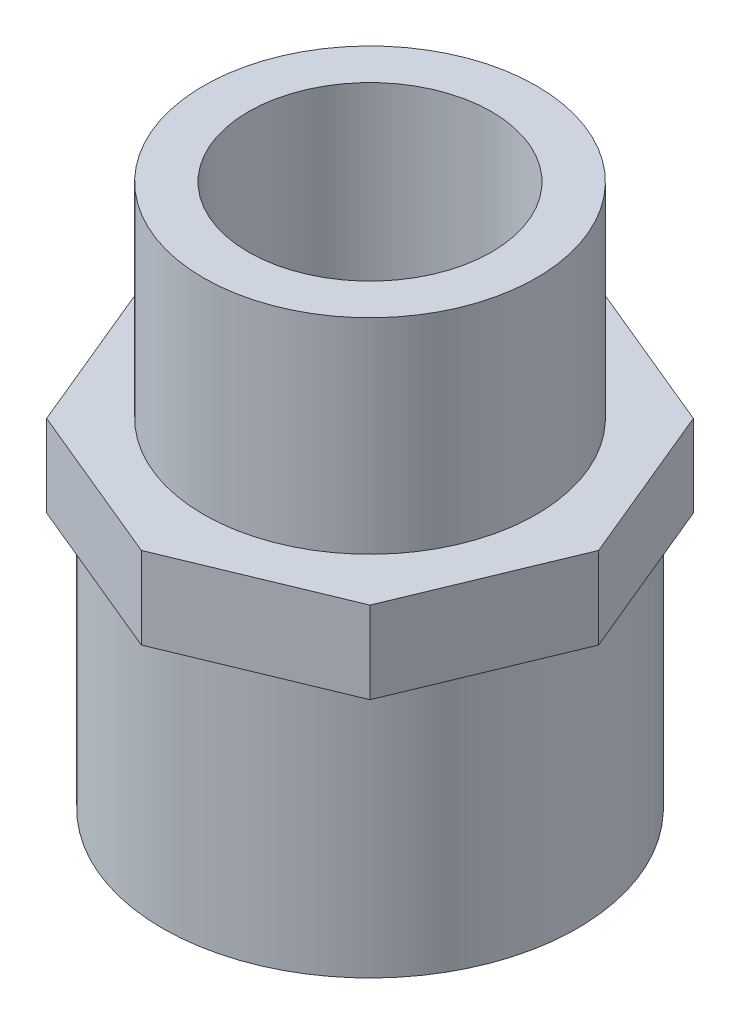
ISO-10303-21;
HEADER;
FILE_DESCRIPTION(('STEP AP214'),'2;1');
FILE_NAME('part.step','',(''),(''),'','','');
FILE_SCHEMA(('AUTOMOTIVE_DESIGN { 1 0 10303 214 1 1 1 1 }'));
ENDSEC;
DATA;
#1=APPLICATION_CONTEXT('core data for automotive mechanical design processes');
#2=APPLICATION_PROTOCOL_DEFINITION('international standard','automotive_design',2000,#1);
#3=PRODUCT_CONTEXT('',#1,'mechanical');
#4=PRODUCT('Part','Part','',(#3));
#5=PRODUCT_RELATED_PRODUCT_CATEGORY('part','',(#4));
#6=PRODUCT_DEFINITION_FORMATION('','',#4);
#7=PRODUCT_DEFINITION_CONTEXT('part definition',#1,'design');
#8=PRODUCT_DEFINITION('design','',#6,#7);
#9=PRODUCT_DEFINITION_SHAPE('','',#8);
#10=(LENGTH_UNIT() NAMED_UNIT(*) SI_UNIT(.MILLI.,.METRE.));
#11=(NAMED_UNIT(*) PLANE_ANGLE_UNIT() SI_UNIT($,.RADIAN.));
#12=(NAMED_UNIT(*) SI_UNIT($,.STERADIAN.) SOLID_ANGLE_UNIT());
#13=UNCERTAINTY_MEASURE_WITH_UNIT(LENGTH_MEASURE(1.E-05),#10,'distance_accuracy_value','');
#14=(GEOMETRIC_REPRESENTATION_CONTEXT(3) GLOBAL_UNCERTAINTY_ASSIGNED_CONTEXT((#13)) GLOBAL_UNIT_ASSIGNED_CONTEXT((#10,
#11,#12)) REPRESENTATION_CONTEXT('',''));
#15=CARTESIAN_POINT('',(0.,0.,0.));
#16=DIRECTION('',(0.,0.,1.));
#17=DIRECTION('',(1.,0.,0.));
#18=AXIS2_PLACEMENT_3D('',#15,#16,#17);
#19=CARTESIAN_POINT('',(27.3790269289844,8.12799999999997,-11.3407642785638));
#20=DIRECTION('',(0.,1.,0.));
#21=DIRECTION('',(0.,0.,1.));
#22=AXIS2_PLACEMENT_3D('',#19,#20,#21);
#23=PLANE('',#22);
#24=DIRECTION('',(0.382683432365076,0.,-0.923879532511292));
#25=VECTOR('',#24,1.);
#26=CARTESIAN_POINT('',(16.0382626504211,8.12799999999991,16.0382626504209));
#27=LINE('',#26,#25);
#28=CARTESIAN_POINT('',(16.0382626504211,8.12799999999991,16.0382626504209));
#29=VERTEX_POINT('',#28);
#30=CARTESIAN_POINT('',(22.681528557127,8.12800000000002,-1.2490009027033E-13));
#31=VERTEX_POINT('',#30);
#32=EDGE_CURVE('E165',#29,#31,#27,.T.);
#33=ORIENTED_EDGE('',*,*,#32,.T.);
#34=DIRECTION('',(-0.382683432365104,0.,-0.923879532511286));
#35=VECTOR('',#34,1.);
#36=CARTESIAN_POINT('',(22.681528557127,8.12800000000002,-1.2490009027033E-13));
#37=LINE('',#36,#35);
#38=CARTESIAN_POINT('',(16.0382626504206,8.12800000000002,-16.0382626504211));
#39=VERTEX_POINT('',#38);
#40=EDGE_CURVE('E100',#31,#39,#37,.T.);
#41=ORIENTED_EDGE('',*,*,#40,.T.);
#42=DIRECTION('',(-0.923879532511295,0.,-0.382683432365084));
#43=VECTOR('',#42,1.);
#44=CARTESIAN_POINT('',(16.0382626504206,8.12800000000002,-16.0382626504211));
#45=LINE('',#44,#43);
#46=CARTESIAN_POINT('',(-4.71844785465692E-13,8.12799999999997,-22.6815285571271));
#47=VERTEX_POINT('',#46);
#48=EDGE_CURVE('E206',#39,#47,#45,.T.);
#49=ORIENTED_EDGE('',*,*,#48,.T.);
#50=DIRECTION('',(-0.923879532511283,0.,0.382683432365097));
#51=VECTOR('',#50,1.);
#52=CARTESIAN_POINT('',(-4.71844785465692E-13,8.12799999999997,-22.6815285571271));
#53=LINE('',#52,#51);
#54=CARTESIAN_POINT('',(-16.0382626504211,8.12800000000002,-16.0382626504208));
#55=VERTEX_POINT('',#54);
#56=EDGE_CURVE('E204',#47,#55,#53,.T.);
#57=ORIENTED_EDGE('',*,*,#56,.T.);
#58=DIRECTION('',(-0.382683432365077,0.,0.923879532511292));
#59=VECTOR('',#58,1.);
#60=CARTESIAN_POINT('',(-16.0382626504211,8.12800000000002,-16.0382626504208));
#61=LINE('',#60,#59);
#62=CARTESIAN_POINT('',(-22.6815285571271,8.12800000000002,1.31838984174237E-13));
#63=VERTEX_POINT('',#62);
#64=EDGE_CURVE('E119',#55,#63,#61,.T.);
#65=ORIENTED_EDGE('',*,*,#64,.T.);
#66=DIRECTION('',(0.382683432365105,0.,0.923879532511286));
#67=VECTOR('',#66,1.);
#68=CARTESIAN_POINT('',(-22.6815285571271,8.12800000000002,1.31838984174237E-13));
#69=LINE('',#68,#67);
#70=CARTESIAN_POINT('',(-16.038262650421,8.12799999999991,16.0382626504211));
#71=VERTEX_POINT('',#70);
#72=EDGE_CURVE('E113',#63,#71,#69,.T.);
#73=ORIENTED_EDGE('',*,*,#72,.T.);
#74=DIRECTION('',(0.923879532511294,0.,0.382683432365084));
#75=VECTOR('',#74,1.);
#76=CARTESIAN_POINT('',(-16.038262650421,8.12799999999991,16.0382626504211));
#77=LINE('',#76,#75);
#78=CARTESIAN_POINT('',(0.,8.12799999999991,22.6815285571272));
#79=VERTEX_POINT('',#78);
#80=EDGE_CURVE('E117',#71,#79,#77,.T.);
#81=ORIENTED_EDGE('',*,*,#80,.T.);
#82=DIRECTION('',(0.923879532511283,0.,-0.382683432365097));
#83=VECTOR('',#82,1.);
#84=CARTESIAN_POINT('',(0.,8.12799999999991,22.6815285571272));
#85=LINE('',#84,#83);
#86=EDGE_CURVE('E56',#79,#29,#85,.T.);
#87=ORIENTED_EDGE('',*,*,#86,.T.);
#88=EDGE_LOOP('',(#33,#41,#49,#57,#65,#73,#81,#87));
#89=FACE_BOUND('',#88,.T.);
#90=CARTESIAN_POINT('',(0.,8.12800000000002,0.));
#91=DIRECTION('',(0.,1.,0.));
#92=DIRECTION('',(0.,0.,1.));
#93=AXIS2_PLACEMENT_3D('',#90,#91,#92);
#94=CIRCLE('',#93,16.51);
#95=CARTESIAN_POINT('',(0.,8.12800000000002,16.5100000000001));
#96=VERTEX_POINT('',#95);
#97=EDGE_CURVE('E233',#96,#96,#94,.T.);
#98=ORIENTED_EDGE('',*,*,#97,.F.);
#99=EDGE_LOOP('',(#98));
#100=FACE_BOUND('',#99,.T.);
#101=ADVANCED_FACE('F38',(#89,#100),#23,.T.);
#102=CARTESIAN_POINT('',(27.3790269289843,0.,-11.3407642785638));
#103=DIRECTION('',(0.,1.,0.));
#104=DIRECTION('',(0.,0.,1.));
#105=AXIS2_PLACEMENT_3D('',#102,#103,#104);
#106=PLANE('',#105);
#107=DIRECTION('',(0.382683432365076,0.,-0.923879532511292));
#108=VECTOR('',#107,1.);
#109=CARTESIAN_POINT('',(16.0382626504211,-1.11022302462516E-13,16.0382626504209));
#110=LINE('',#109,#108);
#111=CARTESIAN_POINT('',(16.0382626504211,-1.11022302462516E-13,16.0382626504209));
#112=VERTEX_POINT('',#111);
#113=CARTESIAN_POINT('',(22.681528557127,0.,-1.2490009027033E-13));
#114=VERTEX_POINT('',#113);
#115=EDGE_CURVE('E142',#112,#114,#110,.T.);
#116=ORIENTED_EDGE('',*,*,#115,.F.);
#117=DIRECTION('',(0.923879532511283,0.,-0.382683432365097));
#118=VECTOR('',#117,1.);
#119=CARTESIAN_POINT('',(0.,-1.11022302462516E-13,22.6815285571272));
#120=LINE('',#119,#118);
#121=CARTESIAN_POINT('',(0.,-1.11022302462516E-13,22.6815285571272));
#122=VERTEX_POINT('',#121);
#123=EDGE_CURVE('E91',#122,#112,#120,.T.);
#124=ORIENTED_EDGE('',*,*,#123,.F.);
#125=DIRECTION('',(0.923879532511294,0.,0.382683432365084));
#126=VECTOR('',#125,1.);
#127=CARTESIAN_POINT('',(-16.038262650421,-1.11022302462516E-13,16.0382626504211));
#128=LINE('',#127,#126);
#129=CARTESIAN_POINT('',(-16.038262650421,-1.11022302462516E-13,16.0382626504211));
#130=VERTEX_POINT('',#129);
#131=EDGE_CURVE('E85',#130,#122,#128,.T.);
#132=ORIENTED_EDGE('',*,*,#131,.F.);
#133=DIRECTION('',(0.382683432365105,0.,0.923879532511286));
#134=VECTOR('',#133,1.);
#135=CARTESIAN_POINT('',(-22.6815285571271,0.,2.15105711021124E-13));
#136=LINE('',#135,#134);
#137=CARTESIAN_POINT('',(-22.6815285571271,0.,2.15105711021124E-13));
#138=VERTEX_POINT('',#137);
#139=EDGE_CURVE('E128',#138,#130,#136,.T.);
#140=ORIENTED_EDGE('',*,*,#139,.F.);
#141=DIRECTION('',(-0.382683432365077,0.,0.923879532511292));
#142=VECTOR('',#141,1.);
#143=CARTESIAN_POINT('',(-16.0382626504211,0.,-16.0382626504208));
#144=LINE('',#143,#142);
#145=CARTESIAN_POINT('',(-16.0382626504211,0.,-16.0382626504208));
#146=VERTEX_POINT('',#145);
#147=EDGE_CURVE('E156',#146,#138,#144,.T.);
#148=ORIENTED_EDGE('',*,*,#147,.F.);
#149=DIRECTION('',(-0.923879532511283,0.,0.382683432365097));
#150=VECTOR('',#149,1.);
#151=CARTESIAN_POINT('',(-4.71844785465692E-13,0.,-22.6815285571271));
#152=LINE('',#151,#150);
#153=CARTESIAN_POINT('',(-4.71844785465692E-13,0.,-22.6815285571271));
#154=VERTEX_POINT('',#153);
#155=EDGE_CURVE('E153',#154,#146,#152,.T.);
#156=ORIENTED_EDGE('',*,*,#155,.F.);
#157=DIRECTION('',(-0.923879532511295,0.,-0.382683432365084));
#158=VECTOR('',#157,1.);
#159=CARTESIAN_POINT('',(16.0382626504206,0.,-16.0382626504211));
#160=LINE('',#159,#158);
#161=CARTESIAN_POINT('',(16.0382626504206,0.,-16.0382626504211));
#162=VERTEX_POINT('',#161);
#163=EDGE_CURVE('E150',#162,#154,#160,.T.);
#164=ORIENTED_EDGE('',*,*,#163,.F.);
#165=DIRECTION('',(-0.382683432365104,0.,-0.923879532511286));
#166=VECTOR('',#165,1.);
#167=CARTESIAN_POINT('',(22.681528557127,0.,-1.2490009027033E-13));
#168=LINE('',#167,#166);
#169=EDGE_CURVE('E146',#114,#162,#168,.T.);
#170=ORIENTED_EDGE('',*,*,#169,.F.);
#171=EDGE_LOOP('',(#116,#124,#132,#140,#148,#156,#164,#170));
#172=FACE_BOUND('',#171,.T.);
#173=CARTESIAN_POINT('',(0.,0.,0.));
#174=DIRECTION('',(0.,1.,0.));
#175=DIRECTION('',(0.,0.,1.));
#176=AXIS2_PLACEMENT_3D('',#173,#174,#175);
#177=CIRCLE('',#176,20.574);
#178=CARTESIAN_POINT('',(0.,0.,20.5740000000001));
#179=VERTEX_POINT('',#178);
#180=EDGE_CURVE('E11',#179,#179,#177,.F.);
#181=ORIENTED_EDGE('',*,*,#180,.F.);
#182=EDGE_LOOP('',(#181));
#183=FACE_BOUND('',#182,.T.);
#184=ADVANCED_FACE('F191',(#172,#183),#106,.F.);
#185=CARTESIAN_POINT('',(0.,0.,0.));
#186=DIRECTION('',(0.,-1.,0.));
#187=DIRECTION('',(0.,0.,-1.));
#188=AXIS2_PLACEMENT_3D('',#185,#186,#187);
#189=CIRCLE('',#188,16.637);
#190=CARTESIAN_POINT('',(0.,0.,-16.637));
#191=VERTEX_POINT('',#190);
#192=EDGE_CURVE('E225',#191,#191,#189,.T.);
#193=ORIENTED_EDGE('',*,*,#192,.T.);
#194=EDGE_LOOP('',(#193));
#195=FACE_BOUND('',#194,.T.);
#196=CARTESIAN_POINT('',(0.,0.,0.));
#197=DIRECTION('',(0.,1.,0.));
#198=DIRECTION('',(0.,0.,1.));
#199=AXIS2_PLACEMENT_3D('',#196,#197,#198);
#200=CIRCLE('',#199,12.065);
#201=CARTESIAN_POINT('',(0.,0.,12.065));
#202=VERTEX_POINT('',#201);
#203=EDGE_CURVE('E147',#202,#202,#200,.T.);
#204=ORIENTED_EDGE('',*,*,#203,.T.);
#205=EDGE_LOOP('',(#204));
#206=FACE_BOUND('',#205,.T.);
#207=ADVANCED_FACE('F268',(#195,#206),#106,.F.);
#208=CARTESIAN_POINT('',(16.0382626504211,8.12799999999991,16.0382626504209));
#209=DIRECTION('',(-0.923879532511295,0.,-0.382683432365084));
#210=DIRECTION('',(-0.382683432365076,0.,0.923879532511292));
#211=AXIS2_PLACEMENT_3D('',#208,#209,#210);
#212=PLANE('',#211);
#213=ORIENTED_EDGE('',*,*,#115,.T.);
#214=DIRECTION('',(0.,-1.,0.));
#215=VECTOR('',#214,1.);
#216=CARTESIAN_POINT('',(22.681528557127,8.12800000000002,-1.2490009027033E-13));
#217=LINE('',#216,#215);
#218=EDGE_CURVE('E48',#31,#114,#217,.T.);
#219=ORIENTED_EDGE('',*,*,#218,.F.);
#220=ORIENTED_EDGE('',*,*,#32,.F.);
#221=DIRECTION('',(0.,-1.,0.));
#222=VECTOR('',#221,1.);
#223=CARTESIAN_POINT('',(16.0382626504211,8.12799999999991,16.0382626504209));
#224=LINE('',#223,#222);
#225=EDGE_CURVE('E138',#29,#112,#224,.T.);
#226=ORIENTED_EDGE('',*,*,#225,.T.);
#227=EDGE_LOOP('',(#213,#219,#220,#226));
#228=FACE_BOUND('',#227,.T.);
#229=ADVANCED_FACE('F40',(#228),#212,.F.);
#230=CARTESIAN_POINT('',(22.681528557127,8.12800000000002,-1.2490009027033E-13));
#231=DIRECTION('',(-0.923879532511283,0.,0.382683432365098));
#232=DIRECTION('',(0.382683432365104,0.,0.923879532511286));
#233=AXIS2_PLACEMENT_3D('',#230,#231,#232);
#234=PLANE('',#233);
#235=ORIENTED_EDGE('',*,*,#169,.T.);
#236=DIRECTION('',(0.,-1.,0.));
#237=VECTOR('',#236,1.);
#238=CARTESIAN_POINT('',(16.0382626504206,8.12800000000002,-16.0382626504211));
#239=LINE('',#238,#237);
#240=EDGE_CURVE('E180',#39,#162,#239,.T.);
#241=ORIENTED_EDGE('',*,*,#240,.F.);
#242=ORIENTED_EDGE('',*,*,#40,.F.);
#243=ORIENTED_EDGE('',*,*,#218,.T.);
#244=EDGE_LOOP('',(#235,#241,#242,#243));
#245=FACE_BOUND('',#244,.T.);
#246=ADVANCED_FACE('F186',(#245),#234,.F.);
#247=CARTESIAN_POINT('',(16.0382626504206,8.12800000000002,-16.0382626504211));
#248=DIRECTION('',(-0.382683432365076,0.,0.923879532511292));
#249=DIRECTION('',(0.923879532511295,0.,0.382683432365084));
#250=AXIS2_PLACEMENT_3D('',#247,#248,#249);
#251=PLANE('',#250);
#252=ORIENTED_EDGE('',*,*,#163,.T.);
#253=DIRECTION('',(0.,-1.,0.));
#254=VECTOR('',#253,1.);
#255=CARTESIAN_POINT('',(-4.71844785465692E-13,8.12799999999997,-22.6815285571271));
#256=LINE('',#255,#254);
#257=EDGE_CURVE('E176',#47,#154,#256,.T.);
#258=ORIENTED_EDGE('',*,*,#257,.F.);
#259=ORIENTED_EDGE('',*,*,#48,.F.);
#260=ORIENTED_EDGE('',*,*,#240,.T.);
#261=EDGE_LOOP('',(#252,#258,#259,#260));
#262=FACE_BOUND('',#261,.T.);
#263=ADVANCED_FACE('F198',(#262),#251,.F.);
#264=CARTESIAN_POINT('',(-4.71844785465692E-13,8.12799999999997,-22.6815285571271));
#265=DIRECTION('',(0.382683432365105,0.,0.923879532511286));
#266=DIRECTION('',(0.923879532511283,0.,-0.382683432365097));
#267=AXIS2_PLACEMENT_3D('',#264,#265,#266);
#268=PLANE('',#267);
#269=ORIENTED_EDGE('',*,*,#155,.T.);
#270=DIRECTION('',(0.,-1.,0.));
#271=VECTOR('',#270,1.);
#272=CARTESIAN_POINT('',(-16.0382626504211,8.12800000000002,-16.0382626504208));
#273=LINE('',#272,#271);
#274=EDGE_CURVE('E172',#55,#146,#273,.T.);
#275=ORIENTED_EDGE('',*,*,#274,.F.);
#276=ORIENTED_EDGE('',*,*,#56,.F.);
#277=ORIENTED_EDGE('',*,*,#257,.T.);
#278=EDGE_LOOP('',(#269,#275,#276,#277));
#279=FACE_BOUND('',#278,.T.);
#280=ADVANCED_FACE('F202',(#279),#268,.F.);
#281=CARTESIAN_POINT('',(-16.0382626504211,8.12800000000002,-16.0382626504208));
#282=DIRECTION('',(0.923879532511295,0.,0.382683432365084));
#283=DIRECTION('',(0.382683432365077,0.,-0.923879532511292));
#284=AXIS2_PLACEMENT_3D('',#281,#282,#283);
#285=PLANE('',#284);
#286=ORIENTED_EDGE('',*,*,#147,.T.);
#287=DIRECTION('',(0.,-1.,0.));
#288=VECTOR('',#287,1.);
#289=CARTESIAN_POINT('',(-22.6815285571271,8.12800000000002,1.31838984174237E-13));
#290=LINE('',#289,#288);
#291=EDGE_CURVE('E130',#63,#138,#290,.T.);
#292=ORIENTED_EDGE('',*,*,#291,.F.);
#293=ORIENTED_EDGE('',*,*,#64,.F.);
#294=ORIENTED_EDGE('',*,*,#274,.T.);
#295=EDGE_LOOP('',(#286,#292,#293,#294));
#296=FACE_BOUND('',#295,.T.);
#297=ADVANCED_FACE('F282',(#296),#285,.F.);
#298=CARTESIAN_POINT('',(-22.6815285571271,8.12800000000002,1.31838984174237E-13));
#299=DIRECTION('',(0.923879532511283,0.,-0.382683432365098));
#300=DIRECTION('',(-0.382683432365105,0.,-0.923879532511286));
#301=AXIS2_PLACEMENT_3D('',#298,#299,#300);
#302=PLANE('',#301);
#303=ORIENTED_EDGE('',*,*,#139,.T.);
#304=DIRECTION('',(0.,-1.,0.));
#305=VECTOR('',#304,1.);
#306=CARTESIAN_POINT('',(-16.038262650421,8.12799999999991,16.0382626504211));
#307=LINE('',#306,#305);
#308=EDGE_CURVE('E125',#71,#130,#307,.T.);
#309=ORIENTED_EDGE('',*,*,#308,.F.);
#310=ORIENTED_EDGE('',*,*,#72,.F.);
#311=ORIENTED_EDGE('',*,*,#291,.T.);
#312=EDGE_LOOP('',(#303,#309,#310,#311));
#313=FACE_BOUND('',#312,.T.);
#314=ADVANCED_FACE('F126',(#313),#302,.F.);
#315=CARTESIAN_POINT('',(-16.038262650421,8.12799999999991,16.0382626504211));
#316=DIRECTION('',(0.382683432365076,0.,-0.923879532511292));
#317=DIRECTION('',(-0.923879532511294,0.,-0.382683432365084));
#318=AXIS2_PLACEMENT_3D('',#315,#316,#317);
#319=PLANE('',#318);
#320=ORIENTED_EDGE('',*,*,#131,.T.);
#321=DIRECTION('',(0.,-1.,0.));
#322=VECTOR('',#321,1.);
#323=CARTESIAN_POINT('',(0.,8.12799999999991,22.6815285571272));
#324=LINE('',#323,#322);
#325=EDGE_CURVE('E131',#79,#122,#324,.T.);
#326=ORIENTED_EDGE('',*,*,#325,.F.);
#327=ORIENTED_EDGE('',*,*,#80,.F.);
#328=ORIENTED_EDGE('',*,*,#308,.T.);
#329=EDGE_LOOP('',(#320,#326,#327,#328));
#330=FACE_BOUND('',#329,.T.);
#331=ADVANCED_FACE('F133',(#330),#319,.F.);
#332=CARTESIAN_POINT('',(0.,8.12799999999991,22.6815285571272));
#333=DIRECTION('',(-0.382683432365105,0.,-0.923879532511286));
#334=DIRECTION('',(-0.923879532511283,0.,0.382683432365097));
#335=AXIS2_PLACEMENT_3D('',#332,#333,#334);
#336=PLANE('',#335);
#337=ORIENTED_EDGE('',*,*,#123,.T.);
#338=ORIENTED_EDGE('',*,*,#225,.F.);
#339=ORIENTED_EDGE('',*,*,#86,.F.);
#340=ORIENTED_EDGE('',*,*,#325,.T.);
#341=EDGE_LOOP('',(#337,#338,#339,#340));
#342=FACE_BOUND('',#341,.T.);
#343=ADVANCED_FACE('F275',(#342),#336,.F.);
#344=CARTESIAN_POINT('',(0.,8.12800000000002,0.));
#345=DIRECTION('',(0.,-1.,0.));
#346=DIRECTION('',(0.,0.,-1.));
#347=AXIS2_PLACEMENT_3D('',#344,#345,#346);
#348=CYLINDRICAL_SURFACE('',#347,12.065);
#349=ORIENTED_EDGE('',*,*,#203,.F.);
#350=EDGE_LOOP('',(#349));
#351=FACE_BOUND('',#350,.T.);
#352=CARTESIAN_POINT('',(0.,28.448,0.));
#353=DIRECTION('',(0.,1.,0.));
#354=DIRECTION('',(0.,0.,1.));
#355=AXIS2_PLACEMENT_3D('',#352,#353,#354);
#356=CIRCLE('',#355,12.065);
#357=CARTESIAN_POINT('',(0.,28.448,12.065));
#358=VERTEX_POINT('',#357);
#359=EDGE_CURVE('E237',#358,#358,#356,.T.);
#360=ORIENTED_EDGE('',*,*,#359,.T.);
#361=EDGE_LOOP('',(#360));
#362=FACE_BOUND('',#361,.T.);
#363=ADVANCED_FACE('F246',(#351,#362),#348,.F.);
#364=CARTESIAN_POINT('',(0.,-25.4,1.11022302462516E-13));
#365=DIRECTION('',(0.,-1.,0.));
#366=DIRECTION('',(0.,0.,-1.));
#367=AXIS2_PLACEMENT_3D('',#364,#365,#366);
#368=PLANE('',#367);
#369=CARTESIAN_POINT('',(0.,-25.4,1.11022302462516E-13));
#370=DIRECTION('',(0.,-1.,0.));
#371=DIRECTION('',(0.,0.,-1.));
#372=AXIS2_PLACEMENT_3D('',#369,#370,#371);
#373=CIRCLE('',#372,20.574);
#374=CARTESIAN_POINT('',(0.,-25.4,-20.5739999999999));
#375=VERTEX_POINT('',#374);
#376=EDGE_CURVE('E220',#375,#375,#373,.T.);
#377=ORIENTED_EDGE('',*,*,#376,.T.);
#378=EDGE_LOOP('',(#377));
#379=FACE_BOUND('',#378,.T.);
#380=CARTESIAN_POINT('',(0.,-25.4,1.11022302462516E-13));
#381=DIRECTION('',(0.,-1.,0.));
#382=DIRECTION('',(0.,0.,-1.));
#383=AXIS2_PLACEMENT_3D('',#380,#381,#382);
#384=CIRCLE('',#383,16.637);
#385=CARTESIAN_POINT('',(0.,-25.4,-16.6369999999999));
#386=VERTEX_POINT('',#385);
#387=EDGE_CURVE('E224',#386,#386,#384,.T.);
#388=ORIENTED_EDGE('',*,*,#387,.F.);
#389=EDGE_LOOP('',(#388));
#390=FACE_BOUND('',#389,.T.);
#391=ADVANCED_FACE('F324',(#379,#390),#368,.T.);
#392=CARTESIAN_POINT('',(0.,-25.4,1.11022302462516E-13));
#393=DIRECTION('',(0.,1.,0.));
#394=DIRECTION('',(0.,0.,1.));
#395=AXIS2_PLACEMENT_3D('',#392,#393,#394);
#396=CYLINDRICAL_SURFACE('',#395,20.574);
#397=ORIENTED_EDGE('',*,*,#376,.F.);
#398=EDGE_LOOP('',(#397));
#399=FACE_BOUND('',#398,.T.);
#400=ORIENTED_EDGE('',*,*,#180,.T.);
#401=EDGE_LOOP('',(#400));
#402=FACE_BOUND('',#401,.T.);
#403=ADVANCED_FACE('F260',(#399,#402),#396,.T.);
#404=CARTESIAN_POINT('',(0.,-25.4,1.11022302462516E-13));
#405=DIRECTION('',(0.,1.,0.));
#406=DIRECTION('',(0.,0.,1.));
#407=AXIS2_PLACEMENT_3D('',#404,#405,#406);
#408=CYLINDRICAL_SURFACE('',#407,16.637);
#409=ORIENTED_EDGE('',*,*,#387,.T.);
#410=EDGE_LOOP('',(#409));
#411=FACE_BOUND('',#410,.T.);
#412=ORIENTED_EDGE('',*,*,#192,.F.);
#413=EDGE_LOOP('',(#412));
#414=FACE_BOUND('',#413,.T.);
#415=ADVANCED_FACE('F251',(#411,#414),#408,.F.);
#416=CARTESIAN_POINT('',(0.,28.448,0.));
#417=DIRECTION('',(0.,1.,0.));
#418=DIRECTION('',(0.,0.,1.));
#419=AXIS2_PLACEMENT_3D('',#416,#417,#418);
#420=PLANE('',#419);
#421=CARTESIAN_POINT('',(0.,28.448,0.));
#422=DIRECTION('',(0.,1.,0.));
#423=DIRECTION('',(0.,0.,1.));
#424=AXIS2_PLACEMENT_3D('',#421,#422,#423);
#425=CIRCLE('',#424,16.51);
#426=CARTESIAN_POINT('',(0.,28.448,16.51));
#427=VERTEX_POINT('',#426);
#428=EDGE_CURVE('E229',#427,#427,#425,.T.);
#429=ORIENTED_EDGE('',*,*,#428,.T.);
#430=EDGE_LOOP('',(#429));
#431=FACE_BOUND('',#430,.T.);
#432=ORIENTED_EDGE('',*,*,#359,.F.);
#433=EDGE_LOOP('',(#432));
#434=FACE_BOUND('',#433,.T.);
#435=ADVANCED_FACE('F248',(#431,#434),#420,.T.);
#436=CARTESIAN_POINT('',(0.,28.448,0.));
#437=DIRECTION('',(0.,-1.,0.));
#438=DIRECTION('',(0.,0.,-1.));
#439=AXIS2_PLACEMENT_3D('',#436,#437,#438);
#440=CYLINDRICAL_SURFACE('',#439,16.51);
#441=ORIENTED_EDGE('',*,*,#428,.F.);
#442=EDGE_LOOP('',(#441));
#443=FACE_BOUND('',#442,.T.);
#444=ORIENTED_EDGE('',*,*,#97,.T.);
#445=EDGE_LOOP('',(#444));
#446=FACE_BOUND('',#445,.T.);
#447=ADVANCED_FACE('F250',(#443,#446),#440,.T.);
#448=CLOSED_SHELL('',(#101,#184,#207,#229,#246,#263,#280,#297,#314,#331,#343,#363,#391,#403,
#415,#435,#447));
#449=MANIFOLD_SOLID_BREP('B2',#448);
#450=ADVANCED_BREP_SHAPE_REPRESENTATION('',(#18,#449),#14);
#451=SHAPE_DEFINITION_REPRESENTATION(#9,#450);
ENDSEC;
END-ISO-10303-21;
